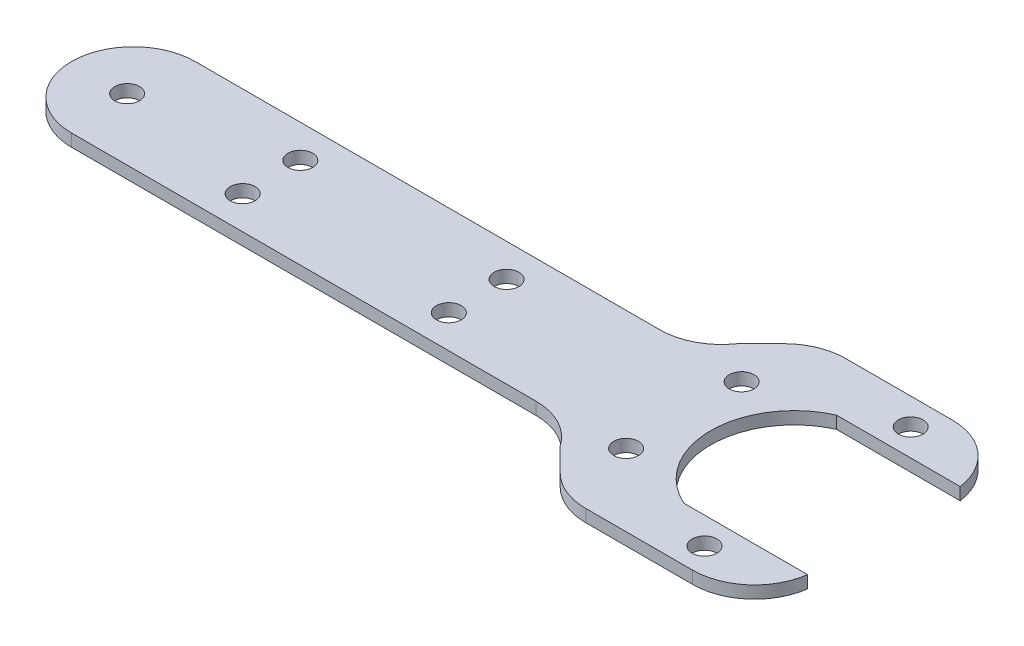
ISO-10303-21;
HEADER;
FILE_DESCRIPTION(('STEP AP214'),'2;1');
FILE_NAME('part.step','',(''),(''),'','','');
FILE_SCHEMA(('AUTOMOTIVE_DESIGN { 1 0 10303 214 1 1 1 1 }'));
ENDSEC;
DATA;
#1=APPLICATION_CONTEXT('core data for automotive mechanical design processes');
#2=APPLICATION_PROTOCOL_DEFINITION('international standard','automotive_design',2000,#1);
#3=PRODUCT_CONTEXT('',#1,'mechanical');
#4=PRODUCT('Part','Part','',(#3));
#5=PRODUCT_RELATED_PRODUCT_CATEGORY('part','',(#4));
#6=PRODUCT_DEFINITION_FORMATION('','',#4);
#7=PRODUCT_DEFINITION_CONTEXT('part definition',#1,'design');
#8=PRODUCT_DEFINITION('design','',#6,#7);
#9=PRODUCT_DEFINITION_SHAPE('','',#8);
#10=(LENGTH_UNIT() NAMED_UNIT(*) SI_UNIT(.MILLI.,.METRE.));
#11=(NAMED_UNIT(*) PLANE_ANGLE_UNIT() SI_UNIT($,.RADIAN.));
#12=(NAMED_UNIT(*) SI_UNIT($,.STERADIAN.) SOLID_ANGLE_UNIT());
#13=UNCERTAINTY_MEASURE_WITH_UNIT(LENGTH_MEASURE(1.E-05),#10,'distance_accuracy_value','');
#14=(GEOMETRIC_REPRESENTATION_CONTEXT(3) GLOBAL_UNCERTAINTY_ASSIGNED_CONTEXT((#13)) GLOBAL_UNIT_ASSIGNED_CONTEXT((#10,
#11,#12)) REPRESENTATION_CONTEXT('',''));
#15=CARTESIAN_POINT('',(0.,0.,0.));
#16=DIRECTION('',(0.,0.,1.));
#17=DIRECTION('',(1.,0.,0.));
#18=AXIS2_PLACEMENT_3D('',#15,#16,#17);
#19=CARTESIAN_POINT('',(-98.5,3.,-31.5));
#20=DIRECTION('',(0.,0.,-1.));
#21=DIRECTION('',(-1.,0.,0.));
#22=AXIS2_PLACEMENT_3D('',#19,#20,#21);
#23=PLANE('',#22);
#24=DIRECTION('',(1.,0.,0.));
#25=VECTOR('',#24,1.);
#26=CARTESIAN_POINT('',(-98.5,0.,-31.5));
#27=LINE('',#26,#25);
#28=CARTESIAN_POINT('',(57.7132034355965,0.,-31.5));
#29=VERTEX_POINT('',#28);
#30=CARTESIAN_POINT('',(83.6339312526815,0.,-31.5));
#31=VERTEX_POINT('',#30);
#32=EDGE_CURVE('E182',#29,#31,#27,.T.);
#33=ORIENTED_EDGE('',*,*,#32,.F.);
#34=DIRECTION('',(0.,-1.,0.));
#35=VECTOR('',#34,1.);
#36=CARTESIAN_POINT('',(57.7132034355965,3.,-31.5));
#37=LINE('',#36,#35);
#38=CARTESIAN_POINT('',(57.7132034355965,3.,-31.5));
#39=VERTEX_POINT('',#38);
#40=EDGE_CURVE('E294',#29,#39,#37,.F.);
#41=ORIENTED_EDGE('',*,*,#40,.T.);
#42=DIRECTION('',(1.,0.,0.));
#43=VECTOR('',#42,1.);
#44=CARTESIAN_POINT('',(-98.5,3.,-31.5));
#45=LINE('',#44,#43);
#46=CARTESIAN_POINT('',(83.6339312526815,3.,-31.5));
#47=VERTEX_POINT('',#46);
#48=EDGE_CURVE('E234',#39,#47,#45,.T.);
#49=ORIENTED_EDGE('',*,*,#48,.T.);
#50=DIRECTION('',(0.,-1.,0.));
#51=VECTOR('',#50,1.);
#52=CARTESIAN_POINT('',(83.6339312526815,0.,-31.5));
#53=LINE('',#52,#51);
#54=EDGE_CURVE('E264',#47,#31,#53,.T.);
#55=ORIENTED_EDGE('',*,*,#54,.T.);
#56=EDGE_LOOP('',(#33,#41,#49,#55));
#57=FACE_BOUND('',#56,.T.);
#58=ADVANCED_FACE('F58',(#57),#23,.T.);
#59=CARTESIAN_POINT('',(0.,3.,0.));
#60=DIRECTION('',(0.,-1.,0.));
#61=DIRECTION('',(0.,0.,-1.));
#62=AXIS2_PLACEMENT_3D('',#59,#60,#61);
#63=PLANE('',#62);
#64=CARTESIAN_POINT('',(-85.,3.,0.));
#65=DIRECTION('',(0.,1.,0.));
#66=DIRECTION('',(0.,0.,1.));
#67=AXIS2_PLACEMENT_3D('',#64,#65,#66);
#68=CIRCLE('',#67,3.00000000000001);
#69=CARTESIAN_POINT('',(-85.,3.,3.00000000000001));
#70=VERTEX_POINT('',#69);
#71=EDGE_CURVE('E396',#70,#70,#68,.T.);
#72=ORIENTED_EDGE('',*,*,#71,.F.);
#73=EDGE_LOOP('',(#72));
#74=FACE_BOUND('',#73,.T.);
#75=CARTESIAN_POINT('',(80.,3.,-25.));
#76=DIRECTION('',(0.,1.,0.));
#77=DIRECTION('',(0.,0.,1.));
#78=AXIS2_PLACEMENT_3D('',#75,#76,#77);
#79=CIRCLE('',#78,3.00000000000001);
#80=CARTESIAN_POINT('',(80.,3.,-22.));
#81=VERTEX_POINT('',#80);
#82=EDGE_CURVE('E390',#81,#81,#79,.T.);
#83=ORIENTED_EDGE('',*,*,#82,.F.);
#84=EDGE_LOOP('',(#83));
#85=FACE_BOUND('',#84,.T.);
#86=CARTESIAN_POINT('',(50.,3.,-14.));
#87=DIRECTION('',(0.,1.,0.));
#88=DIRECTION('',(0.,0.,1.));
#89=AXIS2_PLACEMENT_3D('',#86,#87,#88);
#90=CIRCLE('',#89,3.);
#91=CARTESIAN_POINT('',(50.,3.,-11.));
#92=VERTEX_POINT('',#91);
#93=EDGE_CURVE('E384',#92,#92,#90,.T.);
#94=ORIENTED_EDGE('',*,*,#93,.F.);
#95=EDGE_LOOP('',(#94));
#96=FACE_BOUND('',#95,.T.);
#97=CARTESIAN_POINT('',(80.,3.,25.0000000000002));
#98=DIRECTION('',(0.,1.,0.));
#99=DIRECTION('',(0.,0.,-1.));
#100=AXIS2_PLACEMENT_3D('',#97,#98,#99);
#101=CIRCLE('',#100,3.00000000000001);
#102=CARTESIAN_POINT('',(80.,3.,22.0000000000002));
#103=VERTEX_POINT('',#102);
#104=EDGE_CURVE('E378',#103,#103,#101,.T.);
#105=ORIENTED_EDGE('',*,*,#104,.F.);
#106=EDGE_LOOP('',(#105));
#107=FACE_BOUND('',#106,.T.);
#108=CARTESIAN_POINT('',(50.,3.,14.0000000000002));
#109=DIRECTION('',(0.,1.,0.));
#110=DIRECTION('',(0.,0.,-1.));
#111=AXIS2_PLACEMENT_3D('',#108,#109,#110);
#112=CIRCLE('',#111,3.);
#113=CARTESIAN_POINT('',(50.,3.,11.0000000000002));
#114=VERTEX_POINT('',#113);
#115=EDGE_CURVE('E372',#114,#114,#112,.T.);
#116=ORIENTED_EDGE('',*,*,#115,.F.);
#117=EDGE_LOOP('',(#116));
#118=FACE_BOUND('',#117,.T.);
#119=CARTESIAN_POINT('',(0.,3.,-7.00000000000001));
#120=DIRECTION('',(0.,1.,0.));
#121=DIRECTION('',(0.,0.,1.));
#122=AXIS2_PLACEMENT_3D('',#119,#120,#121);
#123=CIRCLE('',#122,3.);
#124=CARTESIAN_POINT('',(0.,3.,-4.00000000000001));
#125=VERTEX_POINT('',#124);
#126=EDGE_CURVE('E366',#125,#125,#123,.T.);
#127=ORIENTED_EDGE('',*,*,#126,.F.);
#128=EDGE_LOOP('',(#127));
#129=FACE_BOUND('',#128,.T.);
#130=CARTESIAN_POINT('',(0.,3.,7.00000000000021));
#131=DIRECTION('',(0.,1.,0.));
#132=DIRECTION('',(0.,0.,-1.));
#133=AXIS2_PLACEMENT_3D('',#130,#131,#132);
#134=CIRCLE('',#133,3.);
#135=CARTESIAN_POINT('',(0.,3.,4.00000000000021));
#136=VERTEX_POINT('',#135);
#137=EDGE_CURVE('E360',#136,#136,#134,.T.);
#138=ORIENTED_EDGE('',*,*,#137,.F.);
#139=EDGE_LOOP('',(#138));
#140=FACE_BOUND('',#139,.T.);
#141=CARTESIAN_POINT('',(-50.,3.,-7.));
#142=DIRECTION('',(0.,1.,0.));
#143=DIRECTION('',(0.,0.,1.));
#144=AXIS2_PLACEMENT_3D('',#141,#142,#143);
#145=CIRCLE('',#144,3.);
#146=CARTESIAN_POINT('',(-50.,3.,-4.));
#147=VERTEX_POINT('',#146);
#148=EDGE_CURVE('E354',#147,#147,#145,.T.);
#149=ORIENTED_EDGE('',*,*,#148,.F.);
#150=EDGE_LOOP('',(#149));
#151=FACE_BOUND('',#150,.T.);
#152=CARTESIAN_POINT('',(-50.,3.,7.));
#153=DIRECTION('',(0.,1.,0.));
#154=DIRECTION('',(0.,0.,-1.));
#155=AXIS2_PLACEMENT_3D('',#152,#153,#154);
#156=CIRCLE('',#155,3.);
#157=CARTESIAN_POINT('',(-50.,3.,4.));
#158=VERTEX_POINT('',#157);
#159=EDGE_CURVE('E348',#158,#158,#156,.T.);
#160=ORIENTED_EDGE('',*,*,#159,.F.);
#161=EDGE_LOOP('',(#160));
#162=FACE_BOUND('',#161,.T.);
#163=ORIENTED_EDGE('',*,*,#48,.F.);
#164=CARTESIAN_POINT('',(57.7132034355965,3.,-16.5));
#165=DIRECTION('',(0.,-1.,0.));
#166=DIRECTION('',(0.,0.,-1.));
#167=AXIS2_PLACEMENT_3D('',#164,#165,#166);
#168=CIRCLE('',#167,15.);
#169=CARTESIAN_POINT('',(47.1066017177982,3.,-27.1066017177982));
#170=VERTEX_POINT('',#169);
#171=EDGE_CURVE('E299',#39,#170,#168,.F.);
#172=ORIENTED_EDGE('',*,*,#171,.T.);
#173=DIRECTION('',(0.707106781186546,0.,-0.707106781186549));
#174=VECTOR('',#173,1.);
#175=CARTESIAN_POINT('',(51.5,3.,-31.5));
#176=LINE('',#175,#174);
#177=CARTESIAN_POINT('',(41.5,3.,-21.5));
#178=VERTEX_POINT('',#177);
#179=EDGE_CURVE('E269',#170,#178,#176,.F.);
#180=ORIENTED_EDGE('',*,*,#179,.T.);
#181=CARTESIAN_POINT('',(29.1407929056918,3.,-30.));
#182=DIRECTION('',(0.,-1.,0.));
#183=DIRECTION('',(0.,0.,-1.));
#184=AXIS2_PLACEMENT_3D('',#181,#182,#183);
#185=CIRCLE('',#184,15.);
#186=CARTESIAN_POINT('',(29.1407929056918,3.,-15.));
#187=VERTEX_POINT('',#186);
#188=EDGE_CURVE('E286',#178,#187,#185,.T.);
#189=ORIENTED_EDGE('',*,*,#188,.T.);
#190=DIRECTION('',(1.,0.,0.));
#191=VECTOR('',#190,1.);
#192=CARTESIAN_POINT('',(-98.5,3.,-15.));
#193=LINE('',#192,#191);
#194=CARTESIAN_POINT('',(-83.5,3.,-15.));
#195=VERTEX_POINT('',#194);
#196=EDGE_CURVE('E197',#195,#187,#193,.T.);
#197=ORIENTED_EDGE('',*,*,#196,.F.);
#198=CARTESIAN_POINT('',(-83.5,3.,0.));
#199=DIRECTION('',(0.,-1.,0.));
#200=DIRECTION('',(0.,0.,-1.));
#201=AXIS2_PLACEMENT_3D('',#198,#199,#200);
#202=CIRCLE('',#201,15.);
#203=CARTESIAN_POINT('',(-98.5,3.,0.));
#204=VERTEX_POINT('',#203);
#205=EDGE_CURVE('E246',#195,#204,#202,.F.);
#206=ORIENTED_EDGE('',*,*,#205,.T.);
#207=CARTESIAN_POINT('',(-83.5,3.,0.));
#208=DIRECTION('',(0.,-1.,0.));
#209=DIRECTION('',(0.,0.,-1.));
#210=AXIS2_PLACEMENT_3D('',#207,#208,#209);
#211=CIRCLE('',#210,15.);
#212=CARTESIAN_POINT('',(-83.5,3.,15.));
#213=VERTEX_POINT('',#212);
#214=EDGE_CURVE('E244',#204,#213,#211,.F.);
#215=ORIENTED_EDGE('',*,*,#214,.T.);
#216=DIRECTION('',(1.,0.,0.));
#217=VECTOR('',#216,1.);
#218=CARTESIAN_POINT('',(-98.5,3.,15.));
#219=LINE('',#218,#217);
#220=CARTESIAN_POINT('',(29.1407929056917,3.,15.));
#221=VERTEX_POINT('',#220);
#222=EDGE_CURVE('E231',#213,#221,#219,.T.);
#223=ORIENTED_EDGE('',*,*,#222,.T.);
#224=CARTESIAN_POINT('',(29.1407929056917,3.,30.));
#225=DIRECTION('',(0.,-1.,0.));
#226=DIRECTION('',(0.,0.,-1.));
#227=AXIS2_PLACEMENT_3D('',#224,#225,#226);
#228=CIRCLE('',#227,15.);
#229=CARTESIAN_POINT('',(41.5,3.,21.5));
#230=VERTEX_POINT('',#229);
#231=EDGE_CURVE('E290',#221,#230,#228,.T.);
#232=ORIENTED_EDGE('',*,*,#231,.T.);
#233=DIRECTION('',(-0.707106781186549,0.,-0.707106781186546));
#234=VECTOR('',#233,1.);
#235=CARTESIAN_POINT('',(41.5,3.,21.5));
#236=LINE('',#235,#234);
#237=CARTESIAN_POINT('',(47.1066017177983,3.,27.1066017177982));
#238=VERTEX_POINT('',#237);
#239=EDGE_CURVE('E271',#230,#238,#236,.F.);
#240=ORIENTED_EDGE('',*,*,#239,.T.);
#241=CARTESIAN_POINT('',(57.7132034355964,3.,16.5));
#242=DIRECTION('',(0.,-1.,0.));
#243=DIRECTION('',(0.,0.,-1.));
#244=AXIS2_PLACEMENT_3D('',#241,#242,#243);
#245=CIRCLE('',#244,15.);
#246=CARTESIAN_POINT('',(57.7132034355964,3.,31.5));
#247=VERTEX_POINT('',#246);
#248=EDGE_CURVE('E297',#238,#247,#245,.F.);
#249=ORIENTED_EDGE('',*,*,#248,.T.);
#250=DIRECTION('',(1.,0.,0.));
#251=VECTOR('',#250,1.);
#252=CARTESIAN_POINT('',(-98.5,3.,31.5));
#253=LINE('',#252,#251);
#254=CARTESIAN_POINT('',(83.6339312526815,3.,31.5));
#255=VERTEX_POINT('',#254);
#256=EDGE_CURVE('E236',#247,#255,#253,.T.);
#257=ORIENTED_EDGE('',*,*,#256,.T.);
#258=CARTESIAN_POINT('',(83.6339312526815,3.,16.5));
#259=DIRECTION('',(0.,-1.,0.));
#260=DIRECTION('',(0.,0.,-1.));
#261=AXIS2_PLACEMENT_3D('',#258,#259,#260);
#262=CIRCLE('',#261,15.);
#263=CARTESIAN_POINT('',(98.5,3.,18.5));
#264=VERTEX_POINT('',#263);
#265=EDGE_CURVE('E262',#255,#264,#262,.F.);
#266=ORIENTED_EDGE('',*,*,#265,.T.);
#267=DIRECTION('',(-1.,0.,0.));
#268=VECTOR('',#267,1.);
#269=CARTESIAN_POINT('',(98.5,3.,18.5));
#270=LINE('',#269,#268);
#271=CARTESIAN_POINT('',(68.5,3.,18.5));
#272=VERTEX_POINT('',#271);
#273=EDGE_CURVE('E217',#264,#272,#270,.T.);
#274=ORIENTED_EDGE('',*,*,#273,.T.);
#275=CARTESIAN_POINT('',(76.7604166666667,3.,0.));
#276=DIRECTION('',(0.,1.,0.));
#277=DIRECTION('',(0.,0.,1.));
#278=AXIS2_PLACEMENT_3D('',#275,#276,#277);
#279=CIRCLE('',#278,20.2604166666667);
#280=CARTESIAN_POINT('',(68.5,3.,-18.5));
#281=VERTEX_POINT('',#280);
#282=EDGE_CURVE('E205',#281,#272,#279,.T.);
#283=ORIENTED_EDGE('',*,*,#282,.F.);
#284=DIRECTION('',(-1.,0.,0.));
#285=VECTOR('',#284,1.);
#286=CARTESIAN_POINT('',(98.5,3.,-18.5));
#287=LINE('',#286,#285);
#288=CARTESIAN_POINT('',(98.5,3.,-18.5));
#289=VERTEX_POINT('',#288);
#290=EDGE_CURVE('E208',#289,#281,#287,.T.);
#291=ORIENTED_EDGE('',*,*,#290,.F.);
#292=CARTESIAN_POINT('',(83.6339312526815,3.,-16.5));
#293=DIRECTION('',(0.,-1.,0.));
#294=DIRECTION('',(0.,0.,-1.));
#295=AXIS2_PLACEMENT_3D('',#292,#293,#294);
#296=CIRCLE('',#295,15.);
#297=EDGE_CURVE('E203',#289,#47,#296,.F.);
#298=ORIENTED_EDGE('',*,*,#297,.T.);
#299=EDGE_LOOP('',(#163,#172,#180,#189,#197,#206,#215,#223,#232,#240,#249,#257,#266,#274,#283,
#291,#298));
#300=FACE_BOUND('',#299,.T.);
#301=ADVANCED_FACE('F318',(#74,#85,#96,#107,#118,#129,#140,#151,#162,#300),#63,.F.);
#302=CARTESIAN_POINT('',(0.,0.,0.));
#303=DIRECTION('',(0.,-1.,0.));
#304=DIRECTION('',(0.,0.,-1.));
#305=AXIS2_PLACEMENT_3D('',#302,#303,#304);
#306=PLANE('',#305);
#307=CARTESIAN_POINT('',(-85.,0.,0.));
#308=DIRECTION('',(0.,1.,0.));
#309=DIRECTION('',(0.,0.,1.));
#310=AXIS2_PLACEMENT_3D('',#307,#308,#309);
#311=CIRCLE('',#310,3.00000000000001);
#312=CARTESIAN_POINT('',(-85.,0.,3.00000000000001));
#313=VERTEX_POINT('',#312);
#314=EDGE_CURVE('E254',#313,#313,#311,.T.);
#315=ORIENTED_EDGE('',*,*,#314,.T.);
#316=EDGE_LOOP('',(#315));
#317=FACE_BOUND('',#316,.T.);
#318=CARTESIAN_POINT('',(80.,0.,-25.));
#319=DIRECTION('',(0.,1.,0.));
#320=DIRECTION('',(0.,0.,1.));
#321=AXIS2_PLACEMENT_3D('',#318,#319,#320);
#322=CIRCLE('',#321,3.00000000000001);
#323=CARTESIAN_POINT('',(80.,0.,-22.));
#324=VERTEX_POINT('',#323);
#325=EDGE_CURVE('E393',#324,#324,#322,.T.);
#326=ORIENTED_EDGE('',*,*,#325,.T.);
#327=EDGE_LOOP('',(#326));
#328=FACE_BOUND('',#327,.T.);
#329=CARTESIAN_POINT('',(50.,0.,-14.));
#330=DIRECTION('',(0.,1.,0.));
#331=DIRECTION('',(0.,0.,1.));
#332=AXIS2_PLACEMENT_3D('',#329,#330,#331);
#333=CIRCLE('',#332,3.);
#334=CARTESIAN_POINT('',(50.,0.,-11.));
#335=VERTEX_POINT('',#334);
#336=EDGE_CURVE('E387',#335,#335,#333,.T.);
#337=ORIENTED_EDGE('',*,*,#336,.T.);
#338=EDGE_LOOP('',(#337));
#339=FACE_BOUND('',#338,.T.);
#340=CARTESIAN_POINT('',(80.,0.,25.0000000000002));
#341=DIRECTION('',(0.,1.,0.));
#342=DIRECTION('',(0.,0.,-1.));
#343=AXIS2_PLACEMENT_3D('',#340,#341,#342);
#344=CIRCLE('',#343,3.00000000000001);
#345=CARTESIAN_POINT('',(80.,0.,22.0000000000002));
#346=VERTEX_POINT('',#345);
#347=EDGE_CURVE('E381',#346,#346,#344,.T.);
#348=ORIENTED_EDGE('',*,*,#347,.T.);
#349=EDGE_LOOP('',(#348));
#350=FACE_BOUND('',#349,.T.);
#351=CARTESIAN_POINT('',(50.,0.,14.0000000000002));
#352=DIRECTION('',(0.,1.,0.));
#353=DIRECTION('',(0.,0.,-1.));
#354=AXIS2_PLACEMENT_3D('',#351,#352,#353);
#355=CIRCLE('',#354,3.);
#356=CARTESIAN_POINT('',(50.,0.,11.0000000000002));
#357=VERTEX_POINT('',#356);
#358=EDGE_CURVE('E375',#357,#357,#355,.T.);
#359=ORIENTED_EDGE('',*,*,#358,.T.);
#360=EDGE_LOOP('',(#359));
#361=FACE_BOUND('',#360,.T.);
#362=CARTESIAN_POINT('',(0.,0.,-7.00000000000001));
#363=DIRECTION('',(0.,1.,0.));
#364=DIRECTION('',(0.,0.,1.));
#365=AXIS2_PLACEMENT_3D('',#362,#363,#364);
#366=CIRCLE('',#365,3.);
#367=CARTESIAN_POINT('',(0.,0.,-4.00000000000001));
#368=VERTEX_POINT('',#367);
#369=EDGE_CURVE('E369',#368,#368,#366,.T.);
#370=ORIENTED_EDGE('',*,*,#369,.T.);
#371=EDGE_LOOP('',(#370));
#372=FACE_BOUND('',#371,.T.);
#373=CARTESIAN_POINT('',(0.,0.,7.00000000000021));
#374=DIRECTION('',(0.,1.,0.));
#375=DIRECTION('',(0.,0.,-1.));
#376=AXIS2_PLACEMENT_3D('',#373,#374,#375);
#377=CIRCLE('',#376,3.);
#378=CARTESIAN_POINT('',(0.,0.,4.00000000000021));
#379=VERTEX_POINT('',#378);
#380=EDGE_CURVE('E363',#379,#379,#377,.T.);
#381=ORIENTED_EDGE('',*,*,#380,.T.);
#382=EDGE_LOOP('',(#381));
#383=FACE_BOUND('',#382,.T.);
#384=CARTESIAN_POINT('',(-50.,0.,-7.));
#385=DIRECTION('',(0.,1.,0.));
#386=DIRECTION('',(0.,0.,1.));
#387=AXIS2_PLACEMENT_3D('',#384,#385,#386);
#388=CIRCLE('',#387,3.);
#389=CARTESIAN_POINT('',(-50.,0.,-4.));
#390=VERTEX_POINT('',#389);
#391=EDGE_CURVE('E357',#390,#390,#388,.T.);
#392=ORIENTED_EDGE('',*,*,#391,.T.);
#393=EDGE_LOOP('',(#392));
#394=FACE_BOUND('',#393,.T.);
#395=CARTESIAN_POINT('',(-50.,0.,7.));
#396=DIRECTION('',(0.,1.,0.));
#397=DIRECTION('',(0.,0.,-1.));
#398=AXIS2_PLACEMENT_3D('',#395,#396,#397);
#399=CIRCLE('',#398,3.);
#400=CARTESIAN_POINT('',(-50.,0.,4.));
#401=VERTEX_POINT('',#400);
#402=EDGE_CURVE('E351',#401,#401,#399,.T.);
#403=ORIENTED_EDGE('',*,*,#402,.T.);
#404=EDGE_LOOP('',(#403));
#405=FACE_BOUND('',#404,.T.);
#406=DIRECTION('',(-0.707106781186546,0.,0.707106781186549));
#407=VECTOR('',#406,1.);
#408=CARTESIAN_POINT('',(10.0000000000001,0.,10.0000000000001));
#409=LINE('',#408,#407);
#410=CARTESIAN_POINT('',(41.5,0.,-21.5));
#411=VERTEX_POINT('',#410);
#412=CARTESIAN_POINT('',(47.1066017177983,0.,-27.1066017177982));
#413=VERTEX_POINT('',#412);
#414=EDGE_CURVE('E274',#411,#413,#409,.F.);
#415=ORIENTED_EDGE('',*,*,#414,.T.);
#416=CARTESIAN_POINT('',(57.7132034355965,0.,-16.5));
#417=DIRECTION('',(0.,-1.,0.));
#418=DIRECTION('',(0.,0.,-1.));
#419=AXIS2_PLACEMENT_3D('',#416,#417,#418);
#420=CIRCLE('',#419,15.);
#421=EDGE_CURVE('E304',#413,#29,#420,.T.);
#422=ORIENTED_EDGE('',*,*,#421,.T.);
#423=ORIENTED_EDGE('',*,*,#32,.T.);
#424=CARTESIAN_POINT('',(83.6339312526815,0.,-16.5));
#425=DIRECTION('',(0.,-1.,0.));
#426=DIRECTION('',(0.,0.,-1.));
#427=AXIS2_PLACEMENT_3D('',#424,#425,#426);
#428=CIRCLE('',#427,15.);
#429=CARTESIAN_POINT('',(98.5,0.,-18.5));
#430=VERTEX_POINT('',#429);
#431=EDGE_CURVE('E175',#31,#430,#428,.T.);
#432=ORIENTED_EDGE('',*,*,#431,.T.);
#433=DIRECTION('',(-1.,0.,0.));
#434=VECTOR('',#433,1.);
#435=CARTESIAN_POINT('',(98.5,0.,-18.5));
#436=LINE('',#435,#434);
#437=CARTESIAN_POINT('',(68.5,0.,-18.5));
#438=VERTEX_POINT('',#437);
#439=EDGE_CURVE('E180',#430,#438,#436,.T.);
#440=ORIENTED_EDGE('',*,*,#439,.T.);
#441=CARTESIAN_POINT('',(76.7604166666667,0.,0.));
#442=DIRECTION('',(0.,-1.,0.));
#443=DIRECTION('',(0.,0.,-1.));
#444=AXIS2_PLACEMENT_3D('',#441,#442,#443);
#445=CIRCLE('',#444,20.2604166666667);
#446=CARTESIAN_POINT('',(68.5,0.,18.5));
#447=VERTEX_POINT('',#446);
#448=EDGE_CURVE('E222',#438,#447,#445,.F.);
#449=ORIENTED_EDGE('',*,*,#448,.T.);
#450=DIRECTION('',(-1.,0.,0.));
#451=VECTOR('',#450,1.);
#452=CARTESIAN_POINT('',(98.5,0.,18.5));
#453=LINE('',#452,#451);
#454=CARTESIAN_POINT('',(98.5,0.,18.5));
#455=VERTEX_POINT('',#454);
#456=EDGE_CURVE('E198',#455,#447,#453,.T.);
#457=ORIENTED_EDGE('',*,*,#456,.F.);
#458=CARTESIAN_POINT('',(83.6339312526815,0.,16.5));
#459=DIRECTION('',(0.,-1.,0.));
#460=DIRECTION('',(0.,0.,-1.));
#461=AXIS2_PLACEMENT_3D('',#458,#459,#460);
#462=CIRCLE('',#461,15.);
#463=CARTESIAN_POINT('',(83.6339312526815,0.,31.5));
#464=VERTEX_POINT('',#463);
#465=EDGE_CURVE('E187',#455,#464,#462,.T.);
#466=ORIENTED_EDGE('',*,*,#465,.T.);
#467=DIRECTION('',(1.,0.,0.));
#468=VECTOR('',#467,1.);
#469=CARTESIAN_POINT('',(-98.5,0.,31.5));
#470=LINE('',#469,#468);
#471=CARTESIAN_POINT('',(57.7132034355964,0.,31.5));
#472=VERTEX_POINT('',#471);
#473=EDGE_CURVE('E237',#472,#464,#470,.T.);
#474=ORIENTED_EDGE('',*,*,#473,.F.);
#475=CARTESIAN_POINT('',(57.7132034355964,0.,16.5));
#476=DIRECTION('',(0.,-1.,0.));
#477=DIRECTION('',(0.,0.,-1.));
#478=AXIS2_PLACEMENT_3D('',#475,#476,#477);
#479=CIRCLE('',#478,15.);
#480=CARTESIAN_POINT('',(47.1066017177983,0.,27.1066017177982));
#481=VERTEX_POINT('',#480);
#482=EDGE_CURVE('E73',#472,#481,#479,.T.);
#483=ORIENTED_EDGE('',*,*,#482,.T.);
#484=DIRECTION('',(0.707106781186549,0.,0.707106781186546));
#485=VECTOR('',#484,1.);
#486=CARTESIAN_POINT('',(9.9999999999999,0.,-9.99999999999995));
#487=LINE('',#486,#485);
#488=CARTESIAN_POINT('',(41.5,0.,21.5));
#489=VERTEX_POINT('',#488);
#490=EDGE_CURVE('E276',#481,#489,#487,.F.);
#491=ORIENTED_EDGE('',*,*,#490,.T.);
#492=CARTESIAN_POINT('',(29.1407929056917,0.,30.));
#493=DIRECTION('',(0.,-1.,0.));
#494=DIRECTION('',(0.,0.,-1.));
#495=AXIS2_PLACEMENT_3D('',#492,#493,#494);
#496=CIRCLE('',#495,15.);
#497=CARTESIAN_POINT('',(29.1407929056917,0.,15.));
#498=VERTEX_POINT('',#497);
#499=EDGE_CURVE('E292',#489,#498,#496,.F.);
#500=ORIENTED_EDGE('',*,*,#499,.T.);
#501=DIRECTION('',(1.,0.,0.));
#502=VECTOR('',#501,1.);
#503=CARTESIAN_POINT('',(-98.5,0.,15.));
#504=LINE('',#503,#502);
#505=CARTESIAN_POINT('',(-83.5,0.,15.));
#506=VERTEX_POINT('',#505);
#507=EDGE_CURVE('E228',#506,#498,#504,.T.);
#508=ORIENTED_EDGE('',*,*,#507,.F.);
#509=CARTESIAN_POINT('',(-83.5,0.,0.));
#510=DIRECTION('',(0.,-1.,0.));
#511=DIRECTION('',(0.,0.,-1.));
#512=AXIS2_PLACEMENT_3D('',#509,#510,#511);
#513=CIRCLE('',#512,15.);
#514=CARTESIAN_POINT('',(-98.5,0.,0.));
#515=VERTEX_POINT('',#514);
#516=EDGE_CURVE('E248',#506,#515,#513,.T.);
#517=ORIENTED_EDGE('',*,*,#516,.T.);
#518=CARTESIAN_POINT('',(-83.5,0.,0.));
#519=DIRECTION('',(0.,-1.,0.));
#520=DIRECTION('',(0.,0.,-1.));
#521=AXIS2_PLACEMENT_3D('',#518,#519,#520);
#522=CIRCLE('',#521,15.);
#523=CARTESIAN_POINT('',(-83.5,0.,-15.));
#524=VERTEX_POINT('',#523);
#525=EDGE_CURVE('E250',#515,#524,#522,.T.);
#526=ORIENTED_EDGE('',*,*,#525,.T.);
#527=DIRECTION('',(1.,0.,0.));
#528=VECTOR('',#527,1.);
#529=CARTESIAN_POINT('',(-98.5,0.,-15.));
#530=LINE('',#529,#528);
#531=CARTESIAN_POINT('',(29.1407929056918,0.,-15.));
#532=VERTEX_POINT('',#531);
#533=EDGE_CURVE('E213',#524,#532,#530,.T.);
#534=ORIENTED_EDGE('',*,*,#533,.T.);
#535=CARTESIAN_POINT('',(29.1407929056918,0.,-30.));
#536=DIRECTION('',(0.,-1.,0.));
#537=DIRECTION('',(0.,0.,-1.));
#538=AXIS2_PLACEMENT_3D('',#535,#536,#537);
#539=CIRCLE('',#538,15.);
#540=EDGE_CURVE('E288',#532,#411,#539,.F.);
#541=ORIENTED_EDGE('',*,*,#540,.T.);
#542=EDGE_LOOP('',(#415,#422,#423,#432,#440,#449,#457,#466,#474,#483,#491,#500,#508,#517,#526,
#534,#541));
#543=FACE_BOUND('',#542,.T.);
#544=ADVANCED_FACE('F178',(#317,#328,#339,#350,#361,#372,#383,#394,#405,#543),#306,.T.);
#545=CARTESIAN_POINT('',(-98.5,3.,31.5));
#546=DIRECTION('',(0.,0.,-1.));
#547=DIRECTION('',(-1.,0.,0.));
#548=AXIS2_PLACEMENT_3D('',#545,#546,#547);
#549=PLANE('',#548);
#550=ORIENTED_EDGE('',*,*,#256,.F.);
#551=DIRECTION('',(0.,1.,0.));
#552=VECTOR('',#551,1.);
#553=CARTESIAN_POINT('',(57.7132034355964,0.,31.5));
#554=LINE('',#553,#552);
#555=EDGE_CURVE('E66',#247,#472,#554,.F.);
#556=ORIENTED_EDGE('',*,*,#555,.T.);
#557=ORIENTED_EDGE('',*,*,#473,.T.);
#558=DIRECTION('',(0.,1.,0.));
#559=VECTOR('',#558,1.);
#560=CARTESIAN_POINT('',(83.6339312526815,3.,31.5));
#561=LINE('',#560,#559);
#562=EDGE_CURVE('E258',#464,#255,#561,.T.);
#563=ORIENTED_EDGE('',*,*,#562,.T.);
#564=EDGE_LOOP('',(#550,#556,#557,#563));
#565=FACE_BOUND('',#564,.T.);
#566=ADVANCED_FACE('F307',(#565),#549,.F.);
#567=CARTESIAN_POINT('',(-98.5,-0.00100000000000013,15.));
#568=DIRECTION('',(0.,0.,1.));
#569=DIRECTION('',(1.,0.,0.));
#570=AXIS2_PLACEMENT_3D('',#567,#568,#569);
#571=PLANE('',#570);
#572=ORIENTED_EDGE('',*,*,#507,.T.);
#573=DIRECTION('',(0.,-1.,0.));
#574=VECTOR('',#573,1.);
#575=CARTESIAN_POINT('',(29.1407929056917,3.,15.));
#576=LINE('',#575,#574);
#577=EDGE_CURVE('E283',#498,#221,#576,.F.);
#578=ORIENTED_EDGE('',*,*,#577,.T.);
#579=ORIENTED_EDGE('',*,*,#222,.F.);
#580=DIRECTION('',(0.,1.,0.));
#581=VECTOR('',#580,1.);
#582=CARTESIAN_POINT('',(-83.5,0.,15.));
#583=LINE('',#582,#581);
#584=EDGE_CURVE('E188',#213,#506,#583,.F.);
#585=ORIENTED_EDGE('',*,*,#584,.T.);
#586=EDGE_LOOP('',(#572,#578,#579,#585));
#587=FACE_BOUND('',#586,.T.);
#588=ADVANCED_FACE('F605',(#587),#571,.T.);
#589=CARTESIAN_POINT('',(-98.5,-0.00100000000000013,-15.));
#590=DIRECTION('',(0.,0.,1.));
#591=DIRECTION('',(1.,0.,0.));
#592=AXIS2_PLACEMENT_3D('',#589,#590,#591);
#593=PLANE('',#592);
#594=ORIENTED_EDGE('',*,*,#196,.T.);
#595=DIRECTION('',(0.,1.,0.));
#596=VECTOR('',#595,1.);
#597=CARTESIAN_POINT('',(29.1407929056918,-0.00100000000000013,-15.));
#598=LINE('',#597,#596);
#599=EDGE_CURVE('E281',#187,#532,#598,.F.);
#600=ORIENTED_EDGE('',*,*,#599,.T.);
#601=ORIENTED_EDGE('',*,*,#533,.F.);
#602=DIRECTION('',(0.,1.,0.));
#603=VECTOR('',#602,1.);
#604=CARTESIAN_POINT('',(-83.5,-0.00100000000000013,-15.));
#605=LINE('',#604,#603);
#606=EDGE_CURVE('E239',#524,#195,#605,.T.);
#607=ORIENTED_EDGE('',*,*,#606,.T.);
#608=EDGE_LOOP('',(#594,#600,#601,#607));
#609=FACE_BOUND('',#608,.T.);
#610=ADVANCED_FACE('F343',(#609),#593,.F.);
#611=CARTESIAN_POINT('',(76.7604166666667,-0.00100000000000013,0.));
#612=DIRECTION('',(0.,1.,0.));
#613=DIRECTION('',(0.,0.,1.));
#614=AXIS2_PLACEMENT_3D('',#611,#612,#613);
#615=CYLINDRICAL_SURFACE('',#614,20.2604166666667);
#616=DIRECTION('',(0.,1.,0.));
#617=VECTOR('',#616,1.);
#618=CARTESIAN_POINT('',(68.5,-0.00100000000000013,-18.5));
#619=LINE('',#618,#617);
#620=EDGE_CURVE('E195',#438,#281,#619,.T.);
#621=ORIENTED_EDGE('',*,*,#620,.T.);
#622=ORIENTED_EDGE('',*,*,#282,.T.);
#623=DIRECTION('',(0.,1.,0.));
#624=VECTOR('',#623,1.);
#625=CARTESIAN_POINT('',(68.5,-0.00100000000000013,18.5));
#626=LINE('',#625,#624);
#627=EDGE_CURVE('E224',#447,#272,#626,.T.);
#628=ORIENTED_EDGE('',*,*,#627,.F.);
#629=ORIENTED_EDGE('',*,*,#448,.F.);
#630=EDGE_LOOP('',(#621,#622,#628,#629));
#631=FACE_BOUND('',#630,.T.);
#632=ADVANCED_FACE('F323',(#631),#615,.F.);
#633=CARTESIAN_POINT('',(98.5,-0.00100000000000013,-18.5));
#634=DIRECTION('',(0.,0.,-1.));
#635=DIRECTION('',(-1.,0.,0.));
#636=AXIS2_PLACEMENT_3D('',#633,#634,#635);
#637=PLANE('',#636);
#638=DIRECTION('',(0.,1.,0.));
#639=VECTOR('',#638,1.);
#640=CARTESIAN_POINT('',(98.5,-0.00100000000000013,-18.5));
#641=LINE('',#640,#639);
#642=EDGE_CURVE('E193',#430,#289,#641,.T.);
#643=ORIENTED_EDGE('',*,*,#642,.T.);
#644=ORIENTED_EDGE('',*,*,#290,.T.);
#645=ORIENTED_EDGE('',*,*,#620,.F.);
#646=ORIENTED_EDGE('',*,*,#439,.F.);
#647=EDGE_LOOP('',(#643,#644,#645,#646));
#648=FACE_BOUND('',#647,.T.);
#649=ADVANCED_FACE('F191',(#648),#637,.F.);
#650=CARTESIAN_POINT('',(98.5,-0.00100000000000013,18.5));
#651=DIRECTION('',(0.,0.,-1.));
#652=DIRECTION('',(-1.,0.,0.));
#653=AXIS2_PLACEMENT_3D('',#650,#651,#652);
#654=PLANE('',#653);
#655=ORIENTED_EDGE('',*,*,#456,.T.);
#656=ORIENTED_EDGE('',*,*,#627,.T.);
#657=ORIENTED_EDGE('',*,*,#273,.F.);
#658=DIRECTION('',(0.,1.,0.));
#659=VECTOR('',#658,1.);
#660=CARTESIAN_POINT('',(98.5,-0.00100000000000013,18.5));
#661=LINE('',#660,#659);
#662=EDGE_CURVE('E204',#455,#264,#661,.T.);
#663=ORIENTED_EDGE('',*,*,#662,.F.);
#664=EDGE_LOOP('',(#655,#656,#657,#663));
#665=FACE_BOUND('',#664,.T.);
#666=ADVANCED_FACE('F321',(#665),#654,.T.);
#667=CARTESIAN_POINT('',(-83.5,3.,0.));
#668=DIRECTION('',(0.,-1.,0.));
#669=DIRECTION('',(0.,0.,-1.));
#670=AXIS2_PLACEMENT_3D('',#667,#668,#669);
#671=CYLINDRICAL_SURFACE('',#670,15.);
#672=DIRECTION('',(0.,1.,0.));
#673=VECTOR('',#672,1.);
#674=CARTESIAN_POINT('',(-98.5,3.,0.));
#675=LINE('',#674,#673);
#676=EDGE_CURVE('E225',#515,#204,#675,.T.);
#677=ORIENTED_EDGE('',*,*,#676,.F.);
#678=ORIENTED_EDGE('',*,*,#516,.F.);
#679=ORIENTED_EDGE('',*,*,#584,.F.);
#680=ORIENTED_EDGE('',*,*,#214,.F.);
#681=EDGE_LOOP('',(#677,#678,#679,#680));
#682=FACE_BOUND('',#681,.T.);
#683=ADVANCED_FACE('F455',(#682),#671,.T.);
#684=CARTESIAN_POINT('',(-83.5,-0.00100000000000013,0.));
#685=DIRECTION('',(0.,1.,0.));
#686=DIRECTION('',(0.,0.,1.));
#687=AXIS2_PLACEMENT_3D('',#684,#685,#686);
#688=CYLINDRICAL_SURFACE('',#687,15.);
#689=ORIENTED_EDGE('',*,*,#525,.F.);
#690=ORIENTED_EDGE('',*,*,#676,.T.);
#691=ORIENTED_EDGE('',*,*,#205,.F.);
#692=ORIENTED_EDGE('',*,*,#606,.F.);
#693=EDGE_LOOP('',(#689,#690,#691,#692));
#694=FACE_BOUND('',#693,.T.);
#695=ADVANCED_FACE('F452',(#694),#688,.T.);
#696=CARTESIAN_POINT('',(83.6339312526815,3.,16.5));
#697=DIRECTION('',(0.,1.,0.));
#698=DIRECTION('',(0.,0.,1.));
#699=AXIS2_PLACEMENT_3D('',#696,#697,#698);
#700=CYLINDRICAL_SURFACE('',#699,15.);
#701=ORIENTED_EDGE('',*,*,#265,.F.);
#702=ORIENTED_EDGE('',*,*,#562,.F.);
#703=ORIENTED_EDGE('',*,*,#465,.F.);
#704=ORIENTED_EDGE('',*,*,#662,.T.);
#705=EDGE_LOOP('',(#701,#702,#703,#704));
#706=FACE_BOUND('',#705,.T.);
#707=ADVANCED_FACE('F314',(#706),#700,.T.);
#708=CARTESIAN_POINT('',(83.6339312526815,3.,-16.5));
#709=DIRECTION('',(0.,1.,0.));
#710=DIRECTION('',(0.,0.,1.));
#711=AXIS2_PLACEMENT_3D('',#708,#709,#710);
#712=CYLINDRICAL_SURFACE('',#711,15.);
#713=ORIENTED_EDGE('',*,*,#297,.F.);
#714=ORIENTED_EDGE('',*,*,#642,.F.);
#715=ORIENTED_EDGE('',*,*,#431,.F.);
#716=ORIENTED_EDGE('',*,*,#54,.F.);
#717=EDGE_LOOP('',(#713,#714,#715,#716));
#718=FACE_BOUND('',#717,.T.);
#719=ADVANCED_FACE('F201',(#718),#712,.T.);
#720=CARTESIAN_POINT('',(41.5,-0.00100000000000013,21.5));
#721=DIRECTION('',(0.707106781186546,0.,-0.707106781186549));
#722=DIRECTION('',(0.,1.,0.));
#723=AXIS2_PLACEMENT_3D('',#720,#721,#722);
#724=PLANE('',#723);
#725=ORIENTED_EDGE('',*,*,#490,.F.);
#726=DIRECTION('',(0.,-1.,0.));
#727=VECTOR('',#726,1.);
#728=CARTESIAN_POINT('',(47.1066017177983,3.,27.1066017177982));
#729=LINE('',#728,#727);
#730=EDGE_CURVE('E12',#481,#238,#729,.F.);
#731=ORIENTED_EDGE('',*,*,#730,.T.);
#732=ORIENTED_EDGE('',*,*,#239,.F.);
#733=DIRECTION('',(0.,1.,0.));
#734=VECTOR('',#733,1.);
#735=CARTESIAN_POINT('',(41.5,-0.00100000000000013,21.5));
#736=LINE('',#735,#734);
#737=EDGE_CURVE('E266',#489,#230,#736,.T.);
#738=ORIENTED_EDGE('',*,*,#737,.F.);
#739=EDGE_LOOP('',(#725,#731,#732,#738));
#740=FACE_BOUND('',#739,.T.);
#741=ADVANCED_FACE('F464',(#740),#724,.F.);
#742=CARTESIAN_POINT('',(51.5,3.,-31.5));
#743=DIRECTION('',(0.707106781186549,0.,0.707106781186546));
#744=DIRECTION('',(0.,1.,0.));
#745=AXIS2_PLACEMENT_3D('',#742,#743,#744);
#746=PLANE('',#745);
#747=ORIENTED_EDGE('',*,*,#179,.F.);
#748=DIRECTION('',(0.,1.,0.));
#749=VECTOR('',#748,1.);
#750=CARTESIAN_POINT('',(47.1066017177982,3.,-27.1066017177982));
#751=LINE('',#750,#749);
#752=EDGE_CURVE('E301',#170,#413,#751,.F.);
#753=ORIENTED_EDGE('',*,*,#752,.T.);
#754=ORIENTED_EDGE('',*,*,#414,.F.);
#755=DIRECTION('',(0.,-1.,0.));
#756=VECTOR('',#755,1.);
#757=CARTESIAN_POINT('',(41.5,-0.00100000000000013,-21.5));
#758=LINE('',#757,#756);
#759=EDGE_CURVE('E278',#178,#411,#758,.T.);
#760=ORIENTED_EDGE('',*,*,#759,.F.);
#761=EDGE_LOOP('',(#747,#753,#754,#760));
#762=FACE_BOUND('',#761,.T.);
#763=ADVANCED_FACE('F334',(#762),#746,.F.);
#764=CARTESIAN_POINT('',(29.1407929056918,-0.00100000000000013,-30.));
#765=DIRECTION('',(0.,1.,0.));
#766=DIRECTION('',(0.,0.,1.));
#767=AXIS2_PLACEMENT_3D('',#764,#765,#766);
#768=CYLINDRICAL_SURFACE('',#767,15.);
#769=ORIENTED_EDGE('',*,*,#540,.F.);
#770=ORIENTED_EDGE('',*,*,#599,.F.);
#771=ORIENTED_EDGE('',*,*,#188,.F.);
#772=ORIENTED_EDGE('',*,*,#759,.T.);
#773=EDGE_LOOP('',(#769,#770,#771,#772));
#774=FACE_BOUND('',#773,.T.);
#775=ADVANCED_FACE('F338',(#774),#768,.F.);
#776=CARTESIAN_POINT('',(29.1407929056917,-0.00100000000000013,30.));
#777=DIRECTION('',(0.,1.,0.));
#778=DIRECTION('',(0.,0.,1.));
#779=AXIS2_PLACEMENT_3D('',#776,#777,#778);
#780=CYLINDRICAL_SURFACE('',#779,15.);
#781=ORIENTED_EDGE('',*,*,#499,.F.);
#782=ORIENTED_EDGE('',*,*,#737,.T.);
#783=ORIENTED_EDGE('',*,*,#231,.F.);
#784=ORIENTED_EDGE('',*,*,#577,.F.);
#785=EDGE_LOOP('',(#781,#782,#783,#784));
#786=FACE_BOUND('',#785,.T.);
#787=ADVANCED_FACE('F478',(#786),#780,.F.);
#788=CARTESIAN_POINT('',(57.7132034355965,3.,-16.5));
#789=DIRECTION('',(0.,-1.,0.));
#790=DIRECTION('',(0.,0.,-1.));
#791=AXIS2_PLACEMENT_3D('',#788,#789,#790);
#792=CYLINDRICAL_SURFACE('',#791,15.);
#793=ORIENTED_EDGE('',*,*,#421,.F.);
#794=ORIENTED_EDGE('',*,*,#752,.F.);
#795=ORIENTED_EDGE('',*,*,#171,.F.);
#796=ORIENTED_EDGE('',*,*,#40,.F.);
#797=EDGE_LOOP('',(#793,#794,#795,#796));
#798=FACE_BOUND('',#797,.T.);
#799=ADVANCED_FACE('F328',(#798),#792,.T.);
#800=CARTESIAN_POINT('',(57.7132034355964,3.,16.5));
#801=DIRECTION('',(0.,-1.,0.));
#802=DIRECTION('',(0.,0.,-1.));
#803=AXIS2_PLACEMENT_3D('',#800,#801,#802);
#804=CYLINDRICAL_SURFACE('',#803,15.);
#805=ORIENTED_EDGE('',*,*,#248,.F.);
#806=ORIENTED_EDGE('',*,*,#730,.F.);
#807=ORIENTED_EDGE('',*,*,#482,.F.);
#808=ORIENTED_EDGE('',*,*,#555,.F.);
#809=EDGE_LOOP('',(#805,#806,#807,#808));
#810=FACE_BOUND('',#809,.T.);
#811=ADVANCED_FACE('F60',(#810),#804,.T.);
#812=CARTESIAN_POINT('',(-50.,0.,7.));
#813=DIRECTION('',(0.,1.,0.));
#814=DIRECTION('',(0.,0.,1.));
#815=AXIS2_PLACEMENT_3D('',#812,#813,#814);
#816=CYLINDRICAL_SURFACE('',#815,3.);
#817=ORIENTED_EDGE('',*,*,#402,.F.);
#818=EDGE_LOOP('',(#817));
#819=FACE_BOUND('',#818,.T.);
#820=ORIENTED_EDGE('',*,*,#159,.T.);
#821=EDGE_LOOP('',(#820));
#822=FACE_BOUND('',#821,.T.);
#823=ADVANCED_FACE('F430',(#819,#822),#816,.F.);
#824=CARTESIAN_POINT('',(-50.,0.,-7.));
#825=DIRECTION('',(0.,1.,0.));
#826=DIRECTION('',(0.,0.,1.));
#827=AXIS2_PLACEMENT_3D('',#824,#825,#826);
#828=CYLINDRICAL_SURFACE('',#827,3.);
#829=ORIENTED_EDGE('',*,*,#391,.F.);
#830=EDGE_LOOP('',(#829));
#831=FACE_BOUND('',#830,.T.);
#832=ORIENTED_EDGE('',*,*,#148,.T.);
#833=EDGE_LOOP('',(#832));
#834=FACE_BOUND('',#833,.T.);
#835=ADVANCED_FACE('F432',(#831,#834),#828,.F.);
#836=CARTESIAN_POINT('',(0.,0.,7.00000000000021));
#837=DIRECTION('',(0.,1.,0.));
#838=DIRECTION('',(0.,0.,1.));
#839=AXIS2_PLACEMENT_3D('',#836,#837,#838);
#840=CYLINDRICAL_SURFACE('',#839,3.);
#841=ORIENTED_EDGE('',*,*,#380,.F.);
#842=EDGE_LOOP('',(#841));
#843=FACE_BOUND('',#842,.T.);
#844=ORIENTED_EDGE('',*,*,#137,.T.);
#845=EDGE_LOOP('',(#844));
#846=FACE_BOUND('',#845,.T.);
#847=ADVANCED_FACE('F439',(#843,#846),#840,.F.);
#848=CARTESIAN_POINT('',(0.,0.,-7.00000000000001));
#849=DIRECTION('',(0.,1.,0.));
#850=DIRECTION('',(0.,0.,1.));
#851=AXIS2_PLACEMENT_3D('',#848,#849,#850);
#852=CYLINDRICAL_SURFACE('',#851,3.);
#853=ORIENTED_EDGE('',*,*,#369,.F.);
#854=EDGE_LOOP('',(#853));
#855=FACE_BOUND('',#854,.T.);
#856=ORIENTED_EDGE('',*,*,#126,.T.);
#857=EDGE_LOOP('',(#856));
#858=FACE_BOUND('',#857,.T.);
#859=ADVANCED_FACE('F519',(#855,#858),#852,.F.);
#860=CARTESIAN_POINT('',(50.,0.,14.0000000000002));
#861=DIRECTION('',(0.,1.,0.));
#862=DIRECTION('',(0.,0.,1.));
#863=AXIS2_PLACEMENT_3D('',#860,#861,#862);
#864=CYLINDRICAL_SURFACE('',#863,3.);
#865=ORIENTED_EDGE('',*,*,#358,.F.);
#866=EDGE_LOOP('',(#865));
#867=FACE_BOUND('',#866,.T.);
#868=ORIENTED_EDGE('',*,*,#115,.T.);
#869=EDGE_LOOP('',(#868));
#870=FACE_BOUND('',#869,.T.);
#871=ADVANCED_FACE('F529',(#867,#870),#864,.F.);
#872=CARTESIAN_POINT('',(80.,0.,25.0000000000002));
#873=DIRECTION('',(0.,1.,0.));
#874=DIRECTION('',(0.,0.,1.));
#875=AXIS2_PLACEMENT_3D('',#872,#873,#874);
#876=CYLINDRICAL_SURFACE('',#875,3.00000000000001);
#877=ORIENTED_EDGE('',*,*,#347,.F.);
#878=EDGE_LOOP('',(#877));
#879=FACE_BOUND('',#878,.T.);
#880=ORIENTED_EDGE('',*,*,#104,.T.);
#881=EDGE_LOOP('',(#880));
#882=FACE_BOUND('',#881,.T.);
#883=ADVANCED_FACE('F539',(#879,#882),#876,.F.);
#884=CARTESIAN_POINT('',(50.,0.,-14.));
#885=DIRECTION('',(0.,1.,0.));
#886=DIRECTION('',(0.,0.,1.));
#887=AXIS2_PLACEMENT_3D('',#884,#885,#886);
#888=CYLINDRICAL_SURFACE('',#887,3.);
#889=ORIENTED_EDGE('',*,*,#336,.F.);
#890=EDGE_LOOP('',(#889));
#891=FACE_BOUND('',#890,.T.);
#892=ORIENTED_EDGE('',*,*,#93,.T.);
#893=EDGE_LOOP('',(#892));
#894=FACE_BOUND('',#893,.T.);
#895=ADVANCED_FACE('F549',(#891,#894),#888,.F.);
#896=CARTESIAN_POINT('',(80.,0.,-25.));
#897=DIRECTION('',(0.,1.,0.));
#898=DIRECTION('',(0.,0.,1.));
#899=AXIS2_PLACEMENT_3D('',#896,#897,#898);
#900=CYLINDRICAL_SURFACE('',#899,3.00000000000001);
#901=ORIENTED_EDGE('',*,*,#325,.F.);
#902=EDGE_LOOP('',(#901));
#903=FACE_BOUND('',#902,.T.);
#904=ORIENTED_EDGE('',*,*,#82,.T.);
#905=EDGE_LOOP('',(#904));
#906=FACE_BOUND('',#905,.T.);
#907=ADVANCED_FACE('F407',(#903,#906),#900,.F.);
#908=CARTESIAN_POINT('',(-85.,0.,0.));
#909=DIRECTION('',(0.,1.,0.));
#910=DIRECTION('',(0.,0.,1.));
#911=AXIS2_PLACEMENT_3D('',#908,#909,#910);
#912=CYLINDRICAL_SURFACE('',#911,3.00000000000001);
#913=ORIENTED_EDGE('',*,*,#314,.F.);
#914=EDGE_LOOP('',(#913));
#915=FACE_BOUND('',#914,.T.);
#916=ORIENTED_EDGE('',*,*,#71,.T.);
#917=EDGE_LOOP('',(#916));
#918=FACE_BOUND('',#917,.T.);
#919=ADVANCED_FACE('F404',(#915,#918),#912,.F.);
#920=CLOSED_SHELL('',(#58,#301,#544,#566,#588,#610,#632,#649,#666,#683,#695,#707,#719,#741,#763,
#775,#787,#799,#811,#823,#835,#847,#859,#871,#883,#895,#907,#919));
#921=MANIFOLD_SOLID_BREP('B2',#920);
#922=ADVANCED_BREP_SHAPE_REPRESENTATION('',(#18,#921),#14);
#923=SHAPE_DEFINITION_REPRESENTATION(#9,#922);
ENDSEC;
END-ISO-10303-21;
